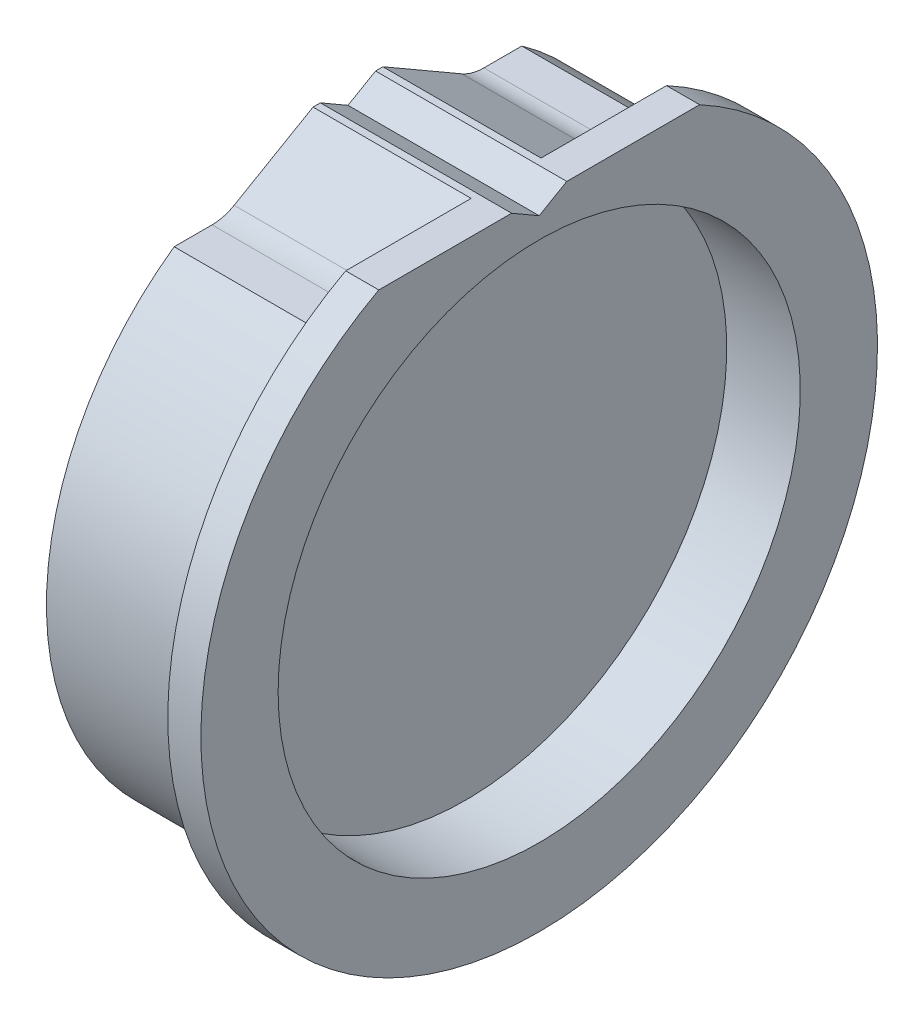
ISO-10303-21;
HEADER;
FILE_DESCRIPTION(('STEP AP214'),'2;1');
FILE_NAME('part.step','',(''),(''),'','','');
FILE_SCHEMA(('AUTOMOTIVE_DESIGN { 1 0 10303 214 1 1 1 1 }'));
ENDSEC;
DATA;
#1=APPLICATION_CONTEXT('core data for automotive mechanical design processes');
#2=APPLICATION_PROTOCOL_DEFINITION('international standard','automotive_design',2000,#1);
#3=PRODUCT_CONTEXT('',#1,'mechanical');
#4=PRODUCT('Part','Part','',(#3));
#5=PRODUCT_RELATED_PRODUCT_CATEGORY('part','',(#4));
#6=PRODUCT_DEFINITION_FORMATION('','',#4);
#7=PRODUCT_DEFINITION_CONTEXT('part definition',#1,'design');
#8=PRODUCT_DEFINITION('design','',#6,#7);
#9=PRODUCT_DEFINITION_SHAPE('','',#8);
#10=(LENGTH_UNIT() NAMED_UNIT(*) SI_UNIT(.MILLI.,.METRE.));
#11=(NAMED_UNIT(*) PLANE_ANGLE_UNIT() SI_UNIT($,.RADIAN.));
#12=(NAMED_UNIT(*) SI_UNIT($,.STERADIAN.) SOLID_ANGLE_UNIT());
#13=UNCERTAINTY_MEASURE_WITH_UNIT(LENGTH_MEASURE(1.E-05),#10,'distance_accuracy_value','');
#14=(GEOMETRIC_REPRESENTATION_CONTEXT(3) GLOBAL_UNCERTAINTY_ASSIGNED_CONTEXT((#13)) GLOBAL_UNIT_ASSIGNED_CONTEXT((#10,
#11,#12)) REPRESENTATION_CONTEXT('',''));
#15=CARTESIAN_POINT('',(0.,0.,0.));
#16=DIRECTION('',(0.,0.,1.));
#17=DIRECTION('',(1.,0.,0.));
#18=AXIS2_PLACEMENT_3D('',#15,#16,#17);
#19=CARTESIAN_POINT('',(5.5,46.,0.));
#20=DIRECTION('',(1.,0.,0.));
#21=DIRECTION('',(0.,0.,-1.));
#22=AXIS2_PLACEMENT_3D('',#19,#20,#21);
#23=PLANE('',#22);
#24=DIRECTION('',(0.,0.,1.));
#25=VECTOR('',#24,1.);
#26=CARTESIAN_POINT('',(5.5,33.5,-31.5238005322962));
#27=LINE('',#26,#25);
#28=CARTESIAN_POINT('',(5.5,33.5,-23.6378933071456));
#29=VERTEX_POINT('',#28);
#30=CARTESIAN_POINT('',(5.5,33.5,-18.4820508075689));
#31=VERTEX_POINT('',#30);
#32=EDGE_CURVE('E185',#29,#31,#27,.T.);
#33=ORIENTED_EDGE('',*,*,#32,.T.);
#34=CARTESIAN_POINT('',(5.5,39.5,-18.4820508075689));
#35=DIRECTION('',(1.,0.,0.));
#36=DIRECTION('',(0.,0.,-1.));
#37=AXIS2_PLACEMENT_3D('',#34,#35,#36);
#38=CIRCLE('',#37,6.);
#39=CARTESIAN_POINT('',(5.5,34.3038475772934,-15.4820508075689));
#40=VERTEX_POINT('',#39);
#41=EDGE_CURVE('E459',#31,#40,#38,.F.);
#42=ORIENTED_EDGE('',*,*,#41,.T.);
#43=DIRECTION('',(0.,0.5,0.866025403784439));
#44=VECTOR('',#43,1.);
#45=CARTESIAN_POINT('',(5.5,40.5,-4.75));
#46=LINE('',#45,#44);
#47=CARTESIAN_POINT('',(5.5,40.5,-4.75));
#48=VERTEX_POINT('',#47);
#49=EDGE_CURVE('E187',#40,#48,#46,.T.);
#50=ORIENTED_EDGE('',*,*,#49,.T.);
#51=DIRECTION('',(0.,0.,-1.));
#52=VECTOR('',#51,1.);
#53=CARTESIAN_POINT('',(5.5,40.5,0.));
#54=LINE('',#53,#52);
#55=CARTESIAN_POINT('',(5.5,40.5,-21.8116941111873));
#56=VERTEX_POINT('',#55);
#57=EDGE_CURVE('E236',#48,#56,#54,.T.);
#58=ORIENTED_EDGE('',*,*,#57,.T.);
#59=CARTESIAN_POINT('',(5.5,0.,0.));
#60=DIRECTION('',(-1.,0.,0.));
#61=DIRECTION('',(0.,0.,1.));
#62=AXIS2_PLACEMENT_3D('',#59,#60,#61);
#63=CIRCLE('',#62,46.);
#64=CARTESIAN_POINT('',(5.5,3.,-45.902069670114));
#65=VERTEX_POINT('',#64);
#66=EDGE_CURVE('E281',#56,#65,#63,.T.);
#67=ORIENTED_EDGE('',*,*,#66,.T.);
#68=DIRECTION('',(0.,0.,-1.));
#69=VECTOR('',#68,1.);
#70=CARTESIAN_POINT('',(5.5,3.,6.9462219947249));
#71=LINE('',#70,#69);
#72=CARTESIAN_POINT('',(5.5,3.,-42.));
#73=VERTEX_POINT('',#72);
#74=EDGE_CURVE('E180',#73,#65,#71,.T.);
#75=ORIENTED_EDGE('',*,*,#74,.F.);
#76=DIRECTION('',(0.,-1.,0.));
#77=VECTOR('',#76,1.);
#78=CARTESIAN_POINT('',(5.5,3.,-42.));
#79=LINE('',#78,#77);
#80=CARTESIAN_POINT('',(5.5,-3.,-42.));
#81=VERTEX_POINT('',#80);
#82=EDGE_CURVE('E172',#73,#81,#79,.T.);
#83=ORIENTED_EDGE('',*,*,#82,.T.);
#84=DIRECTION('',(0.,0.,-1.));
#85=VECTOR('',#84,1.);
#86=CARTESIAN_POINT('',(5.5,-3.,6.9462219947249));
#87=LINE('',#86,#85);
#88=CARTESIAN_POINT('',(5.5,-3.,-45.902069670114));
#89=VERTEX_POINT('',#88);
#90=EDGE_CURVE('E158',#81,#89,#87,.T.);
#91=ORIENTED_EDGE('',*,*,#90,.T.);
#92=CARTESIAN_POINT('',(5.5,40.5,21.8116941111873));
#93=VERTEX_POINT('',#92);
#94=EDGE_CURVE('E280',#89,#93,#63,.T.);
#95=ORIENTED_EDGE('',*,*,#94,.T.);
#96=CARTESIAN_POINT('',(5.5,40.5,4.75));
#97=VERTEX_POINT('',#96);
#98=EDGE_CURVE('E240',#93,#97,#54,.T.);
#99=ORIENTED_EDGE('',*,*,#98,.T.);
#100=DIRECTION('',(0.,-0.5,0.866025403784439));
#101=VECTOR('',#100,1.);
#102=CARTESIAN_POINT('',(5.5,40.5,4.75));
#103=LINE('',#102,#101);
#104=CARTESIAN_POINT('',(5.5,34.3038475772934,15.4820508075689));
#105=VERTEX_POINT('',#104);
#106=EDGE_CURVE('E205',#97,#105,#103,.T.);
#107=ORIENTED_EDGE('',*,*,#106,.T.);
#108=CARTESIAN_POINT('',(5.5,39.5,18.4820508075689));
#109=DIRECTION('',(1.,0.,0.));
#110=DIRECTION('',(0.,0.,-1.));
#111=AXIS2_PLACEMENT_3D('',#108,#109,#110);
#112=CIRCLE('',#111,6.);
#113=CARTESIAN_POINT('',(5.5,33.5,18.4820508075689));
#114=VERTEX_POINT('',#113);
#115=EDGE_CURVE('E457',#105,#114,#112,.F.);
#116=ORIENTED_EDGE('',*,*,#115,.T.);
#117=DIRECTION('',(0.,0.,1.));
#118=VECTOR('',#117,1.);
#119=CARTESIAN_POINT('',(5.5,33.5,31.5238005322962));
#120=LINE('',#119,#118);
#121=CARTESIAN_POINT('',(5.5,33.5,23.6378933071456));
#122=VERTEX_POINT('',#121);
#123=EDGE_CURVE('E202',#114,#122,#120,.T.);
#124=ORIENTED_EDGE('',*,*,#123,.T.);
#125=CARTESIAN_POINT('',(5.5,0.,0.));
#126=DIRECTION('',(-1.,0.,0.));
#127=DIRECTION('',(0.,0.,1.));
#128=AXIS2_PLACEMENT_3D('',#125,#126,#127);
#129=CIRCLE('',#128,41.);
#130=EDGE_CURVE('E284',#29,#122,#129,.T.);
#131=ORIENTED_EDGE('',*,*,#130,.F.);
#132=EDGE_LOOP('',(#33,#42,#50,#58,#67,#75,#83,#91,#95,#99,#107,#116,#124,#131));
#133=FACE_BOUND('',#132,.T.);
#134=ADVANCED_FACE('F16',(#133),#23,.F.);
#135=CARTESIAN_POINT('',(0.,0.,0.));
#136=DIRECTION('',(-1.,0.,0.));
#137=DIRECTION('',(0.,0.,1.));
#138=AXIS2_PLACEMENT_3D('',#135,#136,#137);
#139=CYLINDRICAL_SURFACE('',#138,46.);
#140=DIRECTION('',(-1.,0.,0.));
#141=VECTOR('',#140,1.);
#142=CARTESIAN_POINT('',(0.,3.,-45.902069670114));
#143=LINE('',#142,#141);
#144=CARTESIAN_POINT('',(6.,3.,-45.902069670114));
#145=VERTEX_POINT('',#144);
#146=EDGE_CURVE('E452',#65,#145,#143,.F.);
#147=ORIENTED_EDGE('',*,*,#146,.F.);
#148=ORIENTED_EDGE('',*,*,#66,.F.);
#149=DIRECTION('',(-1.,0.,0.));
#150=VECTOR('',#149,1.);
#151=CARTESIAN_POINT('',(19.4,40.5,-21.8116941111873));
#152=LINE('',#151,#150);
#153=CARTESIAN_POINT('',(10.,40.5,-21.8116941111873));
#154=VERTEX_POINT('',#153);
#155=EDGE_CURVE('E232',#154,#56,#152,.T.);
#156=ORIENTED_EDGE('',*,*,#155,.F.);
#157=CARTESIAN_POINT('',(10.,0.,0.));
#158=DIRECTION('',(-1.,0.,0.));
#159=DIRECTION('',(0.,0.,1.));
#160=AXIS2_PLACEMENT_3D('',#157,#158,#159);
#161=CIRCLE('',#160,46.);
#162=CARTESIAN_POINT('',(10.,40.5,21.8116941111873));
#163=VERTEX_POINT('',#162);
#164=EDGE_CURVE('E277',#154,#163,#161,.T.);
#165=ORIENTED_EDGE('',*,*,#164,.T.);
#166=DIRECTION('',(-1.,0.,0.));
#167=VECTOR('',#166,1.);
#168=CARTESIAN_POINT('',(19.4,40.5,21.8116941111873));
#169=LINE('',#168,#167);
#170=EDGE_CURVE('E233',#163,#93,#169,.T.);
#171=ORIENTED_EDGE('',*,*,#170,.T.);
#172=ORIENTED_EDGE('',*,*,#94,.F.);
#173=DIRECTION('',(-1.,0.,0.));
#174=VECTOR('',#173,1.);
#175=CARTESIAN_POINT('',(0.,-3.,-45.902069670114));
#176=LINE('',#175,#174);
#177=CARTESIAN_POINT('',(6.,-3.,-45.902069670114));
#178=VERTEX_POINT('',#177);
#179=EDGE_CURVE('E306',#178,#89,#176,.T.);
#180=ORIENTED_EDGE('',*,*,#179,.F.);
#181=CARTESIAN_POINT('',(5.5,2.95803989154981,-45.9047927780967));
#182=CARTESIAN_POINT('',(5.58304782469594,2.97208582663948,-45.9038859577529));
#183=CARTESIAN_POINT('',(5.6666882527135,2.98261794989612,-45.9032024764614));
#184=CARTESIAN_POINT('',(5.83455677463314,2.99661640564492,-45.9022916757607));
#185=CARTESIAN_POINT('',(5.91878483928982,3.00008308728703,-45.9020643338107));
#186=CARTESIAN_POINT('',(6.08717422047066,2.99991395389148,-45.9020751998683));
#187=CARTESIAN_POINT('',(6.17133553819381,2.99628363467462,-45.9023130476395));
#188=CARTESIAN_POINT('',(6.33902988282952,2.98197088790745,-45.9032449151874));
#189=CARTESIAN_POINT('',(6.42256291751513,2.97128854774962,-45.9039389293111));
#190=CARTESIAN_POINT('',(6.67141565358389,2.92873069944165,-45.9066816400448));
#191=CARTESIAN_POINT('',(6.83506174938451,2.88634422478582,-45.9093910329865));
#192=CARTESIAN_POINT('',(7.15279004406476,2.77479039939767,-45.9162674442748));
#193=CARTESIAN_POINT('',(7.30687391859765,2.70562775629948,-45.9204342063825));
#194=CARTESIAN_POINT('',(7.60141183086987,2.54240749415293,-45.9297597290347));
#195=CARTESIAN_POINT('',(7.7418535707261,2.44832769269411,-45.9349193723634));
#196=CARTESIAN_POINT('',(8.00498375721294,2.23795121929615,-45.9456487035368));
#197=CARTESIAN_POINT('',(8.12766933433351,2.12165096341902,-45.9512184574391));
#198=CARTESIAN_POINT('',(8.35200331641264,1.86990675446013,-45.9621509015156));
#199=CARTESIAN_POINT('',(8.45361558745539,1.73443057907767,-45.9675132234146));
#200=CARTESIAN_POINT('',(8.63264798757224,1.44832339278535,-45.977416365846));
#201=CARTESIAN_POINT('',(8.71006968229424,1.29769336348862,-45.9819572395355));
#202=CARTESIAN_POINT('',(8.83849919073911,0.985590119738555,-45.98970479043));
#203=CARTESIAN_POINT('',(8.8895158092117,0.824120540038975,-45.9929119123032));
#204=CARTESIAN_POINT('',(8.96370863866,0.494880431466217,-45.9976323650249));
#205=CARTESIAN_POINT('',(8.98688466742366,0.32710986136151,-45.9991456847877));
#206=CARTESIAN_POINT('',(9.00470975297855,-0.00962536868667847,-46.0003065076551));
#207=CARTESIAN_POINT('',(8.9994129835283,-0.178587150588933,-45.9999575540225));
#208=CARTESIAN_POINT('',(8.96057088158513,-0.513216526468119,-45.997441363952));
#209=CARTESIAN_POINT('',(8.92702574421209,-0.678884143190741,-45.9952741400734));
#210=CARTESIAN_POINT('',(8.83267336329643,-1.00214714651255,-45.9893666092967));
#211=CARTESIAN_POINT('',(8.77187922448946,-1.15974637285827,-45.9856270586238));
#212=CARTESIAN_POINT('',(8.6247653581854,-1.46250976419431,-45.9769945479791));
#213=CARTESIAN_POINT('',(8.53844523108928,-1.60767373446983,-45.972101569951));
#214=CARTESIAN_POINT('',(8.34255690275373,-1.88171278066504,-45.9617016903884));
#215=CARTESIAN_POINT('',(8.23294936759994,-2.01055970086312,-45.9561937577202));
#216=CARTESIAN_POINT('',(7.9936770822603,-2.2480350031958,-45.9451901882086));
#217=CARTESIAN_POINT('',(7.86401317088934,-2.35666423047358,-45.9396945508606));
#218=CARTESIAN_POINT('',(7.58813190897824,-2.55074795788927,-45.9293280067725));
#219=CARTESIAN_POINT('',(7.44189655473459,-2.63617690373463,-45.9244577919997));
#220=CARTESIAN_POINT('',(7.13706868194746,-2.78128913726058,-45.9158985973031));
#221=CARTESIAN_POINT('',(6.97847238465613,-2.84096451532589,-45.9122099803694));
#222=CARTESIAN_POINT('',(6.65359800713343,-2.9327990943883,-45.9064354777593));
#223=CARTESIAN_POINT('',(6.48732410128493,-2.96497306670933,-45.9043487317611));
#224=CARTESIAN_POINT('',(6.15185853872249,-3.00088360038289,-45.902015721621));
#225=CARTESIAN_POINT('',(5.98267175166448,-3.00466373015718,-45.901766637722));
#226=CARTESIAN_POINT('',(5.76183290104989,-2.99100112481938,-45.9026567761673));
#227=CARTESIAN_POINT('',(5.7091796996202,-2.98633962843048,-45.9029607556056));
#228=CARTESIAN_POINT('',(5.60428115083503,-2.97425296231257,-45.9037456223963));
#229=CARTESIAN_POINT('',(5.55203527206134,-2.96683238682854,-45.9042262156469));
#230=CARTESIAN_POINT('',(5.5,-2.95803989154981,-45.9047927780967));
#231=B_SPLINE_CURVE_WITH_KNOTS('',3,(#181,#182,#183,#184,#185,#186,#187,#188,#189,#190,#191,
#192,#193,#194,#195,#196,#197,#198,#199,#200,#201,#202,#203,#204,#205,#206,#207,#208,#209,#210,
#211,#212,#213,#214,#215,#216,#217,#218,#219,#220,#221,#222,#223,#224,#225,#226,#227,#228,#229,
#230),.UNSPECIFIED.,.F.,.F.,(4,2,2,2,2,2,2,2,2,2,2,2,2,2,2,2,2,2,2,2,2,2,2,2,4),(0.,
0.25261434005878,0.50521619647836,0.757622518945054,1.01002571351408,1.51461656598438,
2.01911874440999,2.52407157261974,3.02910591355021,3.53499919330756,4.04085972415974,
4.54655146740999,5.05224652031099,5.55697975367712,6.06170950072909,6.5661967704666,
7.07069193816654,7.57604610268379,8.08137913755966,8.58726654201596,9.09330920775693,
9.59907990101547,10.1040743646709,10.262602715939,10.4208682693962),.UNSPECIFIED.);
#232=EDGE_CURVE('E154',#145,#178,#231,.T.);
#233=ORIENTED_EDGE('',*,*,#232,.F.);
#234=EDGE_LOOP('',(#147,#148,#156,#165,#171,#172,#180,#233));
#235=FACE_BOUND('',#234,.T.);
#236=ADVANCED_FACE('F308',(#235),#139,.T.);
#237=CARTESIAN_POINT('',(19.4,40.5,21.8116941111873));
#238=DIRECTION('',(0.,-1.,0.));
#239=DIRECTION('',(0.,0.,-1.));
#240=AXIS2_PLACEMENT_3D('',#237,#238,#239);
#241=PLANE('',#240);
#242=DIRECTION('',(-1.,0.,0.));
#243=VECTOR('',#242,1.);
#244=CARTESIAN_POINT('',(33.1737492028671,40.5,4.75));
#245=LINE('',#244,#243);
#246=CARTESIAN_POINT('',(-16.,40.5,4.75));
#247=VERTEX_POINT('',#246);
#248=EDGE_CURVE('E200',#97,#247,#245,.T.);
#249=ORIENTED_EDGE('',*,*,#248,.F.);
#250=ORIENTED_EDGE('',*,*,#98,.F.);
#251=ORIENTED_EDGE('',*,*,#170,.F.);
#252=DIRECTION('',(0.,0.,1.));
#253=VECTOR('',#252,1.);
#254=CARTESIAN_POINT('',(10.,40.5,0.));
#255=LINE('',#254,#253);
#256=CARTESIAN_POINT('',(10.,40.5,3.75));
#257=VERTEX_POINT('',#256);
#258=EDGE_CURVE('E296',#257,#163,#255,.T.);
#259=ORIENTED_EDGE('',*,*,#258,.F.);
#260=DIRECTION('',(-1.,0.,0.));
#261=VECTOR('',#260,1.);
#262=CARTESIAN_POINT('',(10.001,40.5,3.75));
#263=LINE('',#262,#261);
#264=CARTESIAN_POINT('',(-16.,40.5,3.75));
#265=VERTEX_POINT('',#264);
#266=EDGE_CURVE('E221',#257,#265,#263,.T.);
#267=ORIENTED_EDGE('',*,*,#266,.T.);
#268=DIRECTION('',(0.,0.,1.));
#269=VECTOR('',#268,1.);
#270=CARTESIAN_POINT('',(-16.,40.5,21.8116941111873));
#271=LINE('',#270,#269);
#272=EDGE_CURVE('E224',#265,#247,#271,.T.);
#273=ORIENTED_EDGE('',*,*,#272,.T.);
#274=EDGE_LOOP('',(#249,#250,#251,#259,#267,#273));
#275=FACE_BOUND('',#274,.T.);
#276=ADVANCED_FACE('F355',(#275),#241,.F.);
#277=CARTESIAN_POINT('',(-10.,0.,0.));
#278=DIRECTION('',(1.,0.,0.));
#279=DIRECTION('',(0.,0.,-1.));
#280=AXIS2_PLACEMENT_3D('',#277,#278,#279);
#281=PLANE('',#280);
#282=CARTESIAN_POINT('',(-10.,0.,0.));
#283=DIRECTION('',(-1.,0.,0.));
#284=DIRECTION('',(0.,0.,1.));
#285=AXIS2_PLACEMENT_3D('',#282,#283,#284);
#286=CIRCLE('',#285,20.);
#287=CARTESIAN_POINT('',(-10.,0.,20.));
#288=VERTEX_POINT('',#287);
#289=EDGE_CURVE('E293',#288,#288,#286,.T.);
#290=ORIENTED_EDGE('',*,*,#289,.T.);
#291=EDGE_LOOP('',(#290));
#292=FACE_BOUND('',#291,.T.);
#293=ADVANCED_FACE('F18',(#292),#281,.F.);
#294=CARTESIAN_POINT('',(0.,0.,0.));
#295=DIRECTION('',(-1.,0.,0.));
#296=DIRECTION('',(0.,0.,1.));
#297=AXIS2_PLACEMENT_3D('',#294,#295,#296);
#298=CYLINDRICAL_SURFACE('',#297,20.);
#299=ORIENTED_EDGE('',*,*,#289,.F.);
#300=EDGE_LOOP('',(#299));
#301=FACE_BOUND('',#300,.T.);
#302=CARTESIAN_POINT('',(-16.,0.,0.));
#303=DIRECTION('',(-1.,0.,0.));
#304=DIRECTION('',(0.,0.,1.));
#305=AXIS2_PLACEMENT_3D('',#302,#303,#304);
#306=CIRCLE('',#305,20.);
#307=CARTESIAN_POINT('',(-16.,0.,20.));
#308=VERTEX_POINT('',#307);
#309=EDGE_CURVE('E290',#308,#308,#306,.T.);
#310=ORIENTED_EDGE('',*,*,#309,.T.);
#311=EDGE_LOOP('',(#310));
#312=FACE_BOUND('',#311,.T.);
#313=ADVANCED_FACE('F423',(#301,#312),#298,.F.);
#314=CARTESIAN_POINT('',(-16.,20.,0.));
#315=DIRECTION('',(1.,0.,0.));
#316=DIRECTION('',(0.,0.,-1.));
#317=AXIS2_PLACEMENT_3D('',#314,#315,#316);
#318=PLANE('',#317);
#319=CARTESIAN_POINT('',(-16.,31.5,0.));
#320=DIRECTION('',(-1.,0.,0.));
#321=DIRECTION('',(0.,0.,1.));
#322=AXIS2_PLACEMENT_3D('',#319,#320,#321);
#323=CIRCLE('',#322,3.);
#324=CARTESIAN_POINT('',(-16.,31.5,3.));
#325=VERTEX_POINT('',#324);
#326=EDGE_CURVE('E241',#325,#325,#323,.T.);
#327=ORIENTED_EDGE('',*,*,#326,.F.);
#328=EDGE_LOOP('',(#327));
#329=FACE_BOUND('',#328,.T.);
#330=CARTESIAN_POINT('',(-16.,-22.2738636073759,-22.2738636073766));
#331=DIRECTION('',(-1.,0.,0.));
#332=DIRECTION('',(0.,0.,1.));
#333=AXIS2_PLACEMENT_3D('',#330,#331,#332);
#334=CIRCLE('',#333,2.5);
#335=CARTESIAN_POINT('',(-16.,-22.2738636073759,-19.7738636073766));
#336=VERTEX_POINT('',#335);
#337=EDGE_CURVE('E250',#336,#336,#334,.T.);
#338=ORIENTED_EDGE('',*,*,#337,.F.);
#339=EDGE_LOOP('',(#338));
#340=FACE_BOUND('',#339,.T.);
#341=CARTESIAN_POINT('',(-16.,-22.2738636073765,22.273863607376));
#342=DIRECTION('',(-1.,0.,0.));
#343=DIRECTION('',(0.,0.,1.));
#344=AXIS2_PLACEMENT_3D('',#341,#342,#343);
#345=CIRCLE('',#344,2.5);
#346=CARTESIAN_POINT('',(-16.,-22.2738636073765,24.773863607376));
#347=VERTEX_POINT('',#346);
#348=EDGE_CURVE('E256',#347,#347,#345,.T.);
#349=ORIENTED_EDGE('',*,*,#348,.F.);
#350=EDGE_LOOP('',(#349));
#351=FACE_BOUND('',#350,.T.);
#352=CARTESIAN_POINT('',(-16.,22.2738636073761,22.2738636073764));
#353=DIRECTION('',(-1.,0.,0.));
#354=DIRECTION('',(0.,0.,1.));
#355=AXIS2_PLACEMENT_3D('',#352,#353,#354);
#356=CIRCLE('',#355,2.5);
#357=CARTESIAN_POINT('',(-16.,22.2738636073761,24.7738636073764));
#358=VERTEX_POINT('',#357);
#359=EDGE_CURVE('E262',#358,#358,#356,.T.);
#360=ORIENTED_EDGE('',*,*,#359,.F.);
#361=EDGE_LOOP('',(#360));
#362=FACE_BOUND('',#361,.T.);
#363=CARTESIAN_POINT('',(-16.,22.2738636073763,-22.2738636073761));
#364=DIRECTION('',(-1.,0.,0.));
#365=DIRECTION('',(0.,0.,1.));
#366=AXIS2_PLACEMENT_3D('',#363,#364,#365);
#367=CIRCLE('',#366,2.5);
#368=CARTESIAN_POINT('',(-16.,22.2738636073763,-19.7738636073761));
#369=VERTEX_POINT('',#368);
#370=EDGE_CURVE('E268',#369,#369,#367,.T.);
#371=ORIENTED_EDGE('',*,*,#370,.F.);
#372=EDGE_LOOP('',(#371));
#373=FACE_BOUND('',#372,.T.);
#374=ORIENTED_EDGE('',*,*,#309,.F.);
#375=EDGE_LOOP('',(#374));
#376=FACE_BOUND('',#375,.T.);
#377=DIRECTION('',(0.,0.5,0.866025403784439));
#378=VECTOR('',#377,1.);
#379=CARTESIAN_POINT('',(-16.,40.5,-4.75));
#380=LINE('',#379,#378);
#381=CARTESIAN_POINT('',(-16.,34.3038475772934,-15.4820508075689));
#382=VERTEX_POINT('',#381);
#383=CARTESIAN_POINT('',(-16.,40.5,-4.75));
#384=VERTEX_POINT('',#383);
#385=EDGE_CURVE('E175',#382,#384,#380,.T.);
#386=ORIENTED_EDGE('',*,*,#385,.F.);
#387=CARTESIAN_POINT('',(-16.,39.5,-18.4820508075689));
#388=DIRECTION('',(1.,0.,0.));
#389=DIRECTION('',(0.,0.,-1.));
#390=AXIS2_PLACEMENT_3D('',#387,#388,#389);
#391=CIRCLE('',#390,6.);
#392=CARTESIAN_POINT('',(-16.,33.5,-18.4820508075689));
#393=VERTEX_POINT('',#392);
#394=EDGE_CURVE('E24',#382,#393,#391,.T.);
#395=ORIENTED_EDGE('',*,*,#394,.T.);
#396=DIRECTION('',(0.,0.,1.));
#397=VECTOR('',#396,1.);
#398=CARTESIAN_POINT('',(-16.,33.5,-31.5238005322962));
#399=LINE('',#398,#397);
#400=CARTESIAN_POINT('',(-16.,33.5,-23.6378933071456));
#401=VERTEX_POINT('',#400);
#402=EDGE_CURVE('E171',#401,#393,#399,.T.);
#403=ORIENTED_EDGE('',*,*,#402,.F.);
#404=CARTESIAN_POINT('',(-16.,0.,0.));
#405=DIRECTION('',(-1.,0.,0.));
#406=DIRECTION('',(0.,0.,1.));
#407=AXIS2_PLACEMENT_3D('',#404,#405,#406);
#408=CIRCLE('',#407,41.);
#409=CARTESIAN_POINT('',(-16.,33.5,23.6378933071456));
#410=VERTEX_POINT('',#409);
#411=EDGE_CURVE('E287',#401,#410,#408,.T.);
#412=ORIENTED_EDGE('',*,*,#411,.T.);
#413=DIRECTION('',(0.,0.,1.));
#414=VECTOR('',#413,1.);
#415=CARTESIAN_POINT('',(-16.,33.5,31.5238005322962));
#416=LINE('',#415,#414);
#417=CARTESIAN_POINT('',(-16.,33.5,18.4820508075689));
#418=VERTEX_POINT('',#417);
#419=EDGE_CURVE('E198',#418,#410,#416,.T.);
#420=ORIENTED_EDGE('',*,*,#419,.F.);
#421=CARTESIAN_POINT('',(-16.,39.5,18.4820508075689));
#422=DIRECTION('',(1.,0.,0.));
#423=DIRECTION('',(0.,0.,-1.));
#424=AXIS2_PLACEMENT_3D('',#421,#422,#423);
#425=CIRCLE('',#424,6.);
#426=CARTESIAN_POINT('',(-16.,34.3038475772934,15.4820508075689));
#427=VERTEX_POINT('',#426);
#428=EDGE_CURVE('E11',#418,#427,#425,.T.);
#429=ORIENTED_EDGE('',*,*,#428,.T.);
#430=DIRECTION('',(0.,-0.5,0.866025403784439));
#431=VECTOR('',#430,1.);
#432=CARTESIAN_POINT('',(-16.,40.5,4.75));
#433=LINE('',#432,#431);
#434=EDGE_CURVE('E197',#247,#427,#433,.T.);
#435=ORIENTED_EDGE('',*,*,#434,.F.);
#436=ORIENTED_EDGE('',*,*,#272,.F.);
#437=DIRECTION('',(0.,0.5,0.866025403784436));
#438=VECTOR('',#437,1.);
#439=CARTESIAN_POINT('',(-16.,38.3349364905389,0.));
#440=LINE('',#439,#438);
#441=CARTESIAN_POINT('',(-16.,38.3349364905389,0.));
#442=VERTEX_POINT('',#441);
#443=EDGE_CURVE('E216',#442,#265,#440,.T.);
#444=ORIENTED_EDGE('',*,*,#443,.F.);
#445=DIRECTION('',(0.,-0.5,0.866025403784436));
#446=VECTOR('',#445,1.);
#447=CARTESIAN_POINT('',(-16.,40.5,-3.75));
#448=LINE('',#447,#446);
#449=CARTESIAN_POINT('',(-16.,40.5,-3.75));
#450=VERTEX_POINT('',#449);
#451=EDGE_CURVE('E218',#450,#442,#448,.T.);
#452=ORIENTED_EDGE('',*,*,#451,.F.);
#453=EDGE_CURVE('E230',#384,#450,#271,.T.);
#454=ORIENTED_EDGE('',*,*,#453,.F.);
#455=EDGE_LOOP('',(#386,#395,#403,#412,#420,#429,#435,#436,#444,#452,#454));
#456=FACE_BOUND('',#455,.T.);
#457=ADVANCED_FACE('F410',(#329,#340,#351,#362,#373,#376,#456),#318,.F.);
#458=CARTESIAN_POINT('',(0.,0.,0.));
#459=DIRECTION('',(-1.,0.,0.));
#460=DIRECTION('',(0.,0.,1.));
#461=AXIS2_PLACEMENT_3D('',#458,#459,#460);
#462=CYLINDRICAL_SURFACE('',#461,41.);
#463=ORIENTED_EDGE('',*,*,#411,.F.);
#464=DIRECTION('',(-1.,0.,0.));
#465=VECTOR('',#464,1.);
#466=CARTESIAN_POINT('',(0.,33.5,-23.6378933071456));
#467=LINE('',#466,#465);
#468=EDGE_CURVE('E194',#401,#29,#467,.F.);
#469=ORIENTED_EDGE('',*,*,#468,.T.);
#470=ORIENTED_EDGE('',*,*,#130,.T.);
#471=DIRECTION('',(-1.,0.,0.));
#472=VECTOR('',#471,1.);
#473=CARTESIAN_POINT('',(0.,33.5,23.6378933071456));
#474=LINE('',#473,#472);
#475=EDGE_CURVE('E204',#122,#410,#474,.T.);
#476=ORIENTED_EDGE('',*,*,#475,.T.);
#477=EDGE_LOOP('',(#463,#469,#470,#476));
#478=FACE_BOUND('',#477,.T.);
#479=ADVANCED_FACE('F404',(#478),#462,.T.);
#480=CARTESIAN_POINT('',(10.,46.,0.));
#481=DIRECTION('',(-1.,0.,0.));
#482=DIRECTION('',(0.,0.,1.));
#483=AXIS2_PLACEMENT_3D('',#480,#481,#482);
#484=PLANE('',#483);
#485=DIRECTION('',(0.,0.5,-0.866025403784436));
#486=VECTOR('',#485,1.);
#487=CARTESIAN_POINT('',(10.,40.5,-3.75));
#488=LINE('',#487,#486);
#489=CARTESIAN_POINT('',(10.,38.3349364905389,0.));
#490=VERTEX_POINT('',#489);
#491=CARTESIAN_POINT('',(10.,40.5,-3.75));
#492=VERTEX_POINT('',#491);
#493=EDGE_CURVE('E211',#490,#492,#488,.T.);
#494=ORIENTED_EDGE('',*,*,#493,.F.);
#495=DIRECTION('',(0.,-0.5,-0.866025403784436));
#496=VECTOR('',#495,1.);
#497=CARTESIAN_POINT('',(10.,38.3349364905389,0.));
#498=LINE('',#497,#496);
#499=EDGE_CURVE('E213',#257,#490,#498,.T.);
#500=ORIENTED_EDGE('',*,*,#499,.F.);
#501=ORIENTED_EDGE('',*,*,#258,.T.);
#502=ORIENTED_EDGE('',*,*,#164,.F.);
#503=EDGE_CURVE('E297',#154,#492,#255,.T.);
#504=ORIENTED_EDGE('',*,*,#503,.T.);
#505=EDGE_LOOP('',(#494,#500,#501,#502,#504));
#506=FACE_BOUND('',#505,.T.);
#507=CARTESIAN_POINT('',(10.,0.,0.));
#508=DIRECTION('',(-1.,0.,0.));
#509=DIRECTION('',(0.,0.,1.));
#510=AXIS2_PLACEMENT_3D('',#507,#508,#509);
#511=CIRCLE('',#510,35.5);
#512=CARTESIAN_POINT('',(10.,0.,35.5));
#513=VERTEX_POINT('',#512);
#514=EDGE_CURVE('E274',#513,#513,#511,.T.);
#515=ORIENTED_EDGE('',*,*,#514,.T.);
#516=EDGE_LOOP('',(#515));
#517=FACE_BOUND('',#516,.T.);
#518=ADVANCED_FACE('F401',(#506,#517),#484,.F.);
#519=CARTESIAN_POINT('',(0.,0.,0.));
#520=DIRECTION('',(-1.,0.,0.));
#521=DIRECTION('',(0.,0.,1.));
#522=AXIS2_PLACEMENT_3D('',#519,#520,#521);
#523=CYLINDRICAL_SURFACE('',#522,35.5);
#524=ORIENTED_EDGE('',*,*,#514,.F.);
#525=EDGE_LOOP('',(#524));
#526=FACE_BOUND('',#525,.T.);
#527=CARTESIAN_POINT('',(0.,0.,0.));
#528=DIRECTION('',(-1.,0.,0.));
#529=DIRECTION('',(0.,0.,1.));
#530=AXIS2_PLACEMENT_3D('',#527,#528,#529);
#531=CIRCLE('',#530,35.5);
#532=CARTESIAN_POINT('',(0.,0.,35.5));
#533=VERTEX_POINT('',#532);
#534=EDGE_CURVE('E271',#533,#533,#531,.T.);
#535=ORIENTED_EDGE('',*,*,#534,.T.);
#536=EDGE_LOOP('',(#535));
#537=FACE_BOUND('',#536,.T.);
#538=ADVANCED_FACE('F398',(#526,#537),#523,.F.);
#539=CARTESIAN_POINT('',(0.,35.5,0.));
#540=DIRECTION('',(-1.,0.,0.));
#541=DIRECTION('',(0.,0.,1.));
#542=AXIS2_PLACEMENT_3D('',#539,#540,#541);
#543=PLANE('',#542);
#544=ORIENTED_EDGE('',*,*,#534,.F.);
#545=EDGE_LOOP('',(#544));
#546=FACE_BOUND('',#545,.T.);
#547=ADVANCED_FACE('F394',(#546),#543,.F.);
#548=CARTESIAN_POINT('',(-16.,22.2738636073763,-22.2738636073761));
#549=DIRECTION('',(-1.,0.,0.));
#550=DIRECTION('',(0.,0.,1.));
#551=AXIS2_PLACEMENT_3D('',#548,#549,#550);
#552=CYLINDRICAL_SURFACE('',#551,2.5);
#553=CARTESIAN_POINT('',(-2.,22.2738636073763,-22.2738636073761));
#554=DIRECTION('',(-1.,0.,0.));
#555=DIRECTION('',(0.,0.,1.));
#556=AXIS2_PLACEMENT_3D('',#553,#554,#555);
#557=CIRCLE('',#556,2.5);
#558=CARTESIAN_POINT('',(-2.,22.2738636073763,-19.7738636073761));
#559=VERTEX_POINT('',#558);
#560=EDGE_CURVE('E265',#559,#559,#557,.T.);
#561=ORIENTED_EDGE('',*,*,#560,.F.);
#562=EDGE_LOOP('',(#561));
#563=FACE_BOUND('',#562,.T.);
#564=ORIENTED_EDGE('',*,*,#370,.T.);
#565=EDGE_LOOP('',(#564));
#566=FACE_BOUND('',#565,.T.);
#567=ADVANCED_FACE('F390',(#563,#566),#552,.F.);
#568=CARTESIAN_POINT('',(-2.,22.2738636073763,-22.2738636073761));
#569=DIRECTION('',(-1.,0.,0.));
#570=DIRECTION('',(0.,0.,1.));
#571=AXIS2_PLACEMENT_3D('',#568,#569,#570);
#572=CONICAL_SURFACE('',#571,2.5,1.02974425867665);
#573=CARTESIAN_POINT('',(-0.497848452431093,22.2738636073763,-22.2738636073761));
#574=VERTEX_POINT('',#573);
#575=VERTEX_LOOP('',#574);
#576=FACE_BOUND('',#575,.T.);
#577=ORIENTED_EDGE('',*,*,#560,.T.);
#578=EDGE_LOOP('',(#577));
#579=FACE_BOUND('',#578,.T.);
#580=ADVANCED_FACE('F386',(#576,#579),#572,.F.);
#581=CARTESIAN_POINT('',(-16.,22.2738636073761,22.2738636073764));
#582=DIRECTION('',(-1.,0.,0.));
#583=DIRECTION('',(0.,0.,1.));
#584=AXIS2_PLACEMENT_3D('',#581,#582,#583);
#585=CYLINDRICAL_SURFACE('',#584,2.5);
#586=CARTESIAN_POINT('',(-2.,22.2738636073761,22.2738636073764));
#587=DIRECTION('',(-1.,0.,0.));
#588=DIRECTION('',(0.,0.,1.));
#589=AXIS2_PLACEMENT_3D('',#586,#587,#588);
#590=CIRCLE('',#589,2.5);
#591=CARTESIAN_POINT('',(-2.,22.2738636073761,24.7738636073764));
#592=VERTEX_POINT('',#591);
#593=EDGE_CURVE('E259',#592,#592,#590,.T.);
#594=ORIENTED_EDGE('',*,*,#593,.F.);
#595=EDGE_LOOP('',(#594));
#596=FACE_BOUND('',#595,.T.);
#597=ORIENTED_EDGE('',*,*,#359,.T.);
#598=EDGE_LOOP('',(#597));
#599=FACE_BOUND('',#598,.T.);
#600=ADVANCED_FACE('F382',(#596,#599),#585,.F.);
#601=CARTESIAN_POINT('',(-2.,22.2738636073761,22.2738636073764));
#602=DIRECTION('',(-1.,0.,0.));
#603=DIRECTION('',(0.,0.,1.));
#604=AXIS2_PLACEMENT_3D('',#601,#602,#603);
#605=CONICAL_SURFACE('',#604,2.5,1.02974425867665);
#606=CARTESIAN_POINT('',(-0.497848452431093,22.2738636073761,22.2738636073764));
#607=VERTEX_POINT('',#606);
#608=VERTEX_LOOP('',#607);
#609=FACE_BOUND('',#608,.T.);
#610=ORIENTED_EDGE('',*,*,#593,.T.);
#611=EDGE_LOOP('',(#610));
#612=FACE_BOUND('',#611,.T.);
#613=ADVANCED_FACE('F378',(#609,#612),#605,.F.);
#614=CARTESIAN_POINT('',(-16.,-22.2738636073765,22.273863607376));
#615=DIRECTION('',(-1.,0.,0.));
#616=DIRECTION('',(0.,0.,1.));
#617=AXIS2_PLACEMENT_3D('',#614,#615,#616);
#618=CYLINDRICAL_SURFACE('',#617,2.5);
#619=CARTESIAN_POINT('',(-2.,-22.2738636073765,22.273863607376));
#620=DIRECTION('',(-1.,0.,0.));
#621=DIRECTION('',(0.,0.,1.));
#622=AXIS2_PLACEMENT_3D('',#619,#620,#621);
#623=CIRCLE('',#622,2.5);
#624=CARTESIAN_POINT('',(-2.,-22.2738636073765,24.773863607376));
#625=VERTEX_POINT('',#624);
#626=EDGE_CURVE('E253',#625,#625,#623,.T.);
#627=ORIENTED_EDGE('',*,*,#626,.F.);
#628=EDGE_LOOP('',(#627));
#629=FACE_BOUND('',#628,.T.);
#630=ORIENTED_EDGE('',*,*,#348,.T.);
#631=EDGE_LOOP('',(#630));
#632=FACE_BOUND('',#631,.T.);
#633=ADVANCED_FACE('F374',(#629,#632),#618,.F.);
#634=CARTESIAN_POINT('',(-2.,-22.2738636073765,22.273863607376));
#635=DIRECTION('',(-1.,0.,0.));
#636=DIRECTION('',(0.,0.,1.));
#637=AXIS2_PLACEMENT_3D('',#634,#635,#636);
#638=CONICAL_SURFACE('',#637,2.5,1.02974425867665);
#639=CARTESIAN_POINT('',(-0.497848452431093,-22.2738636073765,22.273863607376));
#640=VERTEX_POINT('',#639);
#641=VERTEX_LOOP('',#640);
#642=FACE_BOUND('',#641,.T.);
#643=ORIENTED_EDGE('',*,*,#626,.T.);
#644=EDGE_LOOP('',(#643));
#645=FACE_BOUND('',#644,.T.);
#646=ADVANCED_FACE('F370',(#642,#645),#638,.F.);
#647=CARTESIAN_POINT('',(-16.,-22.2738636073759,-22.2738636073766));
#648=DIRECTION('',(-1.,0.,0.));
#649=DIRECTION('',(0.,0.,1.));
#650=AXIS2_PLACEMENT_3D('',#647,#648,#649);
#651=CYLINDRICAL_SURFACE('',#650,2.5);
#652=CARTESIAN_POINT('',(-2.,-22.2738636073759,-22.2738636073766));
#653=DIRECTION('',(-1.,0.,0.));
#654=DIRECTION('',(0.,0.,1.));
#655=AXIS2_PLACEMENT_3D('',#652,#653,#654);
#656=CIRCLE('',#655,2.5);
#657=CARTESIAN_POINT('',(-2.,-22.2738636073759,-19.7738636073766));
#658=VERTEX_POINT('',#657);
#659=EDGE_CURVE('E247',#658,#658,#656,.T.);
#660=ORIENTED_EDGE('',*,*,#659,.F.);
#661=EDGE_LOOP('',(#660));
#662=FACE_BOUND('',#661,.T.);
#663=ORIENTED_EDGE('',*,*,#337,.T.);
#664=EDGE_LOOP('',(#663));
#665=FACE_BOUND('',#664,.T.);
#666=ADVANCED_FACE('F366',(#662,#665),#651,.F.);
#667=CARTESIAN_POINT('',(-2.,-22.2738636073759,-22.2738636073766));
#668=DIRECTION('',(-1.,0.,0.));
#669=DIRECTION('',(0.,0.,1.));
#670=AXIS2_PLACEMENT_3D('',#667,#668,#669);
#671=CONICAL_SURFACE('',#670,2.5,1.02974425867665);
#672=CARTESIAN_POINT('',(-0.497848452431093,-22.2738636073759,-22.2738636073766));
#673=VERTEX_POINT('',#672);
#674=VERTEX_LOOP('',#673);
#675=FACE_BOUND('',#674,.T.);
#676=ORIENTED_EDGE('',*,*,#659,.T.);
#677=EDGE_LOOP('',(#676));
#678=FACE_BOUND('',#677,.T.);
#679=ADVANCED_FACE('F362',(#675,#678),#671,.F.);
#680=CARTESIAN_POINT('',(-6.,31.5,0.));
#681=DIRECTION('',(-1.,0.,0.));
#682=DIRECTION('',(0.,0.,1.));
#683=AXIS2_PLACEMENT_3D('',#680,#681,#682);
#684=CONICAL_SURFACE('',#683,3.,1.0471975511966);
#685=CARTESIAN_POINT('',(-4.26794919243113,31.5,0.));
#686=VERTEX_POINT('',#685);
#687=VERTEX_LOOP('',#686);
#688=FACE_BOUND('',#687,.T.);
#689=CARTESIAN_POINT('',(-6.,31.5,0.));
#690=DIRECTION('',(-1.,0.,0.));
#691=DIRECTION('',(0.,0.,1.));
#692=AXIS2_PLACEMENT_3D('',#689,#690,#691);
#693=CIRCLE('',#692,3.);
#694=CARTESIAN_POINT('',(-6.,31.5,3.));
#695=VERTEX_POINT('',#694);
#696=EDGE_CURVE('E244',#695,#695,#693,.T.);
#697=ORIENTED_EDGE('',*,*,#696,.T.);
#698=EDGE_LOOP('',(#697));
#699=FACE_BOUND('',#698,.T.);
#700=ADVANCED_FACE('F358',(#688,#699),#684,.F.);
#701=CARTESIAN_POINT('',(-16.,31.5,0.));
#702=DIRECTION('',(-1.,0.,0.));
#703=DIRECTION('',(0.,0.,1.));
#704=AXIS2_PLACEMENT_3D('',#701,#702,#703);
#705=CYLINDRICAL_SURFACE('',#704,3.);
#706=ORIENTED_EDGE('',*,*,#696,.F.);
#707=EDGE_LOOP('',(#706));
#708=FACE_BOUND('',#707,.T.);
#709=ORIENTED_EDGE('',*,*,#326,.T.);
#710=EDGE_LOOP('',(#709));
#711=FACE_BOUND('',#710,.T.);
#712=ADVANCED_FACE('F353',(#708,#711),#705,.F.);
#713=ORIENTED_EDGE('',*,*,#57,.F.);
#714=DIRECTION('',(-1.,0.,0.));
#715=VECTOR('',#714,1.);
#716=CARTESIAN_POINT('',(33.1737492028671,40.5,-4.75));
#717=LINE('',#716,#715);
#718=EDGE_CURVE('E189',#48,#384,#717,.T.);
#719=ORIENTED_EDGE('',*,*,#718,.T.);
#720=ORIENTED_EDGE('',*,*,#453,.T.);
#721=DIRECTION('',(-1.,0.,0.));
#722=VECTOR('',#721,1.);
#723=CARTESIAN_POINT('',(10.001,40.5,-3.75));
#724=LINE('',#723,#722);
#725=EDGE_CURVE('E225',#492,#450,#724,.T.);
#726=ORIENTED_EDGE('',*,*,#725,.F.);
#727=ORIENTED_EDGE('',*,*,#503,.F.);
#728=ORIENTED_EDGE('',*,*,#155,.T.);
#729=EDGE_LOOP('',(#713,#719,#720,#726,#727,#728));
#730=FACE_BOUND('',#729,.T.);
#731=ADVANCED_FACE('F349',(#730),#241,.F.);
#732=CARTESIAN_POINT('',(10.001,38.3349364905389,0.));
#733=DIRECTION('',(0.,-0.866025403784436,0.5));
#734=DIRECTION('',(0.,-0.5,-0.866025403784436));
#735=AXIS2_PLACEMENT_3D('',#732,#733,#734);
#736=PLANE('',#735);
#737=ORIENTED_EDGE('',*,*,#499,.T.);
#738=DIRECTION('',(-1.,0.,0.));
#739=VECTOR('',#738,1.);
#740=CARTESIAN_POINT('',(10.001,38.3349364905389,0.));
#741=LINE('',#740,#739);
#742=EDGE_CURVE('E222',#490,#442,#741,.T.);
#743=ORIENTED_EDGE('',*,*,#742,.T.);
#744=ORIENTED_EDGE('',*,*,#443,.T.);
#745=ORIENTED_EDGE('',*,*,#266,.F.);
#746=EDGE_LOOP('',(#737,#743,#744,#745));
#747=FACE_BOUND('',#746,.T.);
#748=ADVANCED_FACE('F345',(#747),#736,.F.);
#749=CARTESIAN_POINT('',(10.001,40.5,-3.75));
#750=DIRECTION('',(0.,-0.866025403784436,-0.5));
#751=DIRECTION('',(0.,0.5,-0.866025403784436));
#752=AXIS2_PLACEMENT_3D('',#749,#750,#751);
#753=PLANE('',#752);
#754=ORIENTED_EDGE('',*,*,#493,.T.);
#755=ORIENTED_EDGE('',*,*,#725,.T.);
#756=ORIENTED_EDGE('',*,*,#451,.T.);
#757=ORIENTED_EDGE('',*,*,#742,.F.);
#758=EDGE_LOOP('',(#754,#755,#756,#757));
#759=FACE_BOUND('',#758,.T.);
#760=ADVANCED_FACE('F338',(#759),#753,.F.);
#761=CARTESIAN_POINT('',(33.1737492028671,33.5,31.5238005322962));
#762=DIRECTION('',(0.,-1.,0.));
#763=DIRECTION('',(0.,0.,-1.));
#764=AXIS2_PLACEMENT_3D('',#761,#762,#763);
#765=PLANE('',#764);
#766=ORIENTED_EDGE('',*,*,#123,.F.);
#767=DIRECTION('',(-1.,0.,0.));
#768=VECTOR('',#767,1.);
#769=CARTESIAN_POINT('',(-16.,33.5,18.4820508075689));
#770=LINE('',#769,#768);
#771=EDGE_CURVE('E461',#114,#418,#770,.T.);
#772=ORIENTED_EDGE('',*,*,#771,.T.);
#773=ORIENTED_EDGE('',*,*,#419,.T.);
#774=ORIENTED_EDGE('',*,*,#475,.F.);
#775=EDGE_LOOP('',(#766,#772,#773,#774));
#776=FACE_BOUND('',#775,.T.);
#777=ADVANCED_FACE('F335',(#776),#765,.F.);
#778=CARTESIAN_POINT('',(33.1737492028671,40.5,4.75));
#779=DIRECTION('',(0.,-0.866025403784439,-0.5));
#780=DIRECTION('',(0.,0.5,-0.866025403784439));
#781=AXIS2_PLACEMENT_3D('',#778,#779,#780);
#782=PLANE('',#781);
#783=ORIENTED_EDGE('',*,*,#434,.T.);
#784=DIRECTION('',(-1.,0.,0.));
#785=VECTOR('',#784,1.);
#786=CARTESIAN_POINT('',(5.5,34.3038475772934,15.4820508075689));
#787=LINE('',#786,#785);
#788=EDGE_CURVE('E463',#427,#105,#787,.F.);
#789=ORIENTED_EDGE('',*,*,#788,.T.);
#790=ORIENTED_EDGE('',*,*,#106,.F.);
#791=ORIENTED_EDGE('',*,*,#248,.T.);
#792=EDGE_LOOP('',(#783,#789,#790,#791));
#793=FACE_BOUND('',#792,.T.);
#794=ADVANCED_FACE('F333',(#793),#782,.F.);
#795=CARTESIAN_POINT('',(33.1737492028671,33.5,-31.5238005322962));
#796=DIRECTION('',(0.,-1.,0.));
#797=DIRECTION('',(0.,0.,-1.));
#798=AXIS2_PLACEMENT_3D('',#795,#796,#797);
#799=PLANE('',#798);
#800=ORIENTED_EDGE('',*,*,#402,.T.);
#801=DIRECTION('',(-1.,0.,0.));
#802=VECTOR('',#801,1.);
#803=CARTESIAN_POINT('',(5.5,33.5,-18.4820508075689));
#804=LINE('',#803,#802);
#805=EDGE_CURVE('E453',#393,#31,#804,.F.);
#806=ORIENTED_EDGE('',*,*,#805,.T.);
#807=ORIENTED_EDGE('',*,*,#32,.F.);
#808=ORIENTED_EDGE('',*,*,#468,.F.);
#809=EDGE_LOOP('',(#800,#806,#807,#808));
#810=FACE_BOUND('',#809,.T.);
#811=ADVANCED_FACE('F329',(#810),#799,.F.);
#812=CARTESIAN_POINT('',(33.1737492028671,40.5,-4.75));
#813=DIRECTION('',(0.,-0.866025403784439,0.5));
#814=DIRECTION('',(0.,-0.5,-0.866025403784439));
#815=AXIS2_PLACEMENT_3D('',#812,#813,#814);
#816=PLANE('',#815);
#817=ORIENTED_EDGE('',*,*,#49,.F.);
#818=DIRECTION('',(-1.,0.,0.));
#819=VECTOR('',#818,1.);
#820=CARTESIAN_POINT('',(-16.,34.3038475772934,-15.4820508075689));
#821=LINE('',#820,#819);
#822=EDGE_CURVE('E443',#40,#382,#821,.T.);
#823=ORIENTED_EDGE('',*,*,#822,.T.);
#824=ORIENTED_EDGE('',*,*,#385,.T.);
#825=ORIENTED_EDGE('',*,*,#718,.F.);
#826=EDGE_LOOP('',(#817,#823,#824,#825));
#827=FACE_BOUND('',#826,.T.);
#828=ADVANCED_FACE('F323',(#827),#816,.F.);
#829=CARTESIAN_POINT('',(5.5,3.,6.9462219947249));
#830=DIRECTION('',(0.,-1.,0.));
#831=DIRECTION('',(0.,0.,-1.));
#832=AXIS2_PLACEMENT_3D('',#829,#830,#831);
#833=PLANE('',#832);
#834=ORIENTED_EDGE('',*,*,#146,.T.);
#835=DIRECTION('',(0.,0.,-1.));
#836=VECTOR('',#835,1.);
#837=CARTESIAN_POINT('',(6.,3.,6.9462219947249));
#838=LINE('',#837,#836);
#839=CARTESIAN_POINT('',(6.,3.,-42.));
#840=VERTEX_POINT('',#839);
#841=EDGE_CURVE('E182',#840,#145,#838,.T.);
#842=ORIENTED_EDGE('',*,*,#841,.F.);
#843=DIRECTION('',(-1.,0.,0.));
#844=VECTOR('',#843,1.);
#845=CARTESIAN_POINT('',(5.5,3.,-42.));
#846=LINE('',#845,#844);
#847=EDGE_CURVE('E166',#840,#73,#846,.T.);
#848=ORIENTED_EDGE('',*,*,#847,.T.);
#849=ORIENTED_EDGE('',*,*,#74,.T.);
#850=EDGE_LOOP('',(#834,#842,#848,#849));
#851=FACE_BOUND('',#850,.T.);
#852=ADVANCED_FACE('F320',(#851),#833,.T.);
#853=CARTESIAN_POINT('',(5.5,-3.,6.9462219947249));
#854=DIRECTION('',(0.,1.,0.));
#855=DIRECTION('',(-1.,0.,0.));
#856=AXIS2_PLACEMENT_3D('',#853,#854,#855);
#857=PLANE('',#856);
#858=ORIENTED_EDGE('',*,*,#179,.T.);
#859=ORIENTED_EDGE('',*,*,#90,.F.);
#860=DIRECTION('',(1.,0.,0.));
#861=VECTOR('',#860,1.);
#862=CARTESIAN_POINT('',(5.5,-3.,-42.));
#863=LINE('',#862,#861);
#864=CARTESIAN_POINT('',(6.,-3.,-42.));
#865=VERTEX_POINT('',#864);
#866=EDGE_CURVE('E163',#81,#865,#863,.T.);
#867=ORIENTED_EDGE('',*,*,#866,.T.);
#868=DIRECTION('',(0.,0.,-1.));
#869=VECTOR('',#868,1.);
#870=CARTESIAN_POINT('',(6.,-3.,6.9462219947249));
#871=LINE('',#870,#869);
#872=EDGE_CURVE('E149',#865,#178,#871,.T.);
#873=ORIENTED_EDGE('',*,*,#872,.T.);
#874=EDGE_LOOP('',(#858,#859,#867,#873));
#875=FACE_BOUND('',#874,.T.);
#876=ADVANCED_FACE('F168',(#875),#857,.T.);
#877=CARTESIAN_POINT('',(6.,0.,6.9462219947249));
#878=DIRECTION('',(0.,0.,-1.));
#879=DIRECTION('',(-1.,0.,0.));
#880=AXIS2_PLACEMENT_3D('',#877,#878,#879);
#881=CYLINDRICAL_SURFACE('',#880,3.);
#882=ORIENTED_EDGE('',*,*,#232,.T.);
#883=ORIENTED_EDGE('',*,*,#872,.F.);
#884=CARTESIAN_POINT('',(6.,0.,-42.));
#885=DIRECTION('',(0.,0.,1.));
#886=DIRECTION('',(1.,0.,0.));
#887=AXIS2_PLACEMENT_3D('',#884,#885,#886);
#888=CIRCLE('',#887,3.);
#889=EDGE_CURVE('E152',#865,#840,#888,.T.);
#890=ORIENTED_EDGE('',*,*,#889,.T.);
#891=ORIENTED_EDGE('',*,*,#841,.T.);
#892=EDGE_LOOP('',(#882,#883,#890,#891));
#893=FACE_BOUND('',#892,.T.);
#894=ADVANCED_FACE('F151',(#893),#881,.F.);
#895=CARTESIAN_POINT('',(0.,0.,-42.));
#896=DIRECTION('',(0.,0.,1.));
#897=DIRECTION('',(1.,0.,0.));
#898=AXIS2_PLACEMENT_3D('',#895,#896,#897);
#899=PLANE('',#898);
#900=ORIENTED_EDGE('',*,*,#889,.F.);
#901=ORIENTED_EDGE('',*,*,#866,.F.);
#902=ORIENTED_EDGE('',*,*,#82,.F.);
#903=ORIENTED_EDGE('',*,*,#847,.F.);
#904=EDGE_LOOP('',(#900,#901,#902,#903));
#905=FACE_BOUND('',#904,.T.);
#906=ADVANCED_FACE('F162',(#905),#899,.F.);
#907=CARTESIAN_POINT('',(33.1737492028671,39.5,-18.4820508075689));
#908=DIRECTION('',(1.,0.,0.));
#909=DIRECTION('',(0.,0.,-1.));
#910=AXIS2_PLACEMENT_3D('',#907,#908,#909);
#911=CYLINDRICAL_SURFACE('',#910,6.);
#912=ORIENTED_EDGE('',*,*,#41,.F.);
#913=ORIENTED_EDGE('',*,*,#805,.F.);
#914=ORIENTED_EDGE('',*,*,#394,.F.);
#915=ORIENTED_EDGE('',*,*,#822,.F.);
#916=EDGE_LOOP('',(#912,#913,#914,#915));
#917=FACE_BOUND('',#916,.T.);
#918=ADVANCED_FACE('F316',(#917),#911,.F.);
#919=CARTESIAN_POINT('',(33.1737492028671,39.5,18.4820508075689));
#920=DIRECTION('',(1.,0.,0.));
#921=DIRECTION('',(0.,0.,-1.));
#922=AXIS2_PLACEMENT_3D('',#919,#920,#921);
#923=CYLINDRICAL_SURFACE('',#922,6.);
#924=ORIENTED_EDGE('',*,*,#115,.F.);
#925=ORIENTED_EDGE('',*,*,#788,.F.);
#926=ORIENTED_EDGE('',*,*,#428,.F.);
#927=ORIENTED_EDGE('',*,*,#771,.F.);
#928=EDGE_LOOP('',(#924,#925,#926,#927));
#929=FACE_BOUND('',#928,.T.);
#930=ADVANCED_FACE('F469',(#929),#923,.F.);
#931=CLOSED_SHELL('',(#134,#236,#276,#293,#313,#457,#479,#518,#538,#547,#567,#580,#600,#613,
#633,#646,#666,#679,#700,#712,#731,#748,#760,#777,#794,#811,#828,#852,#876,#894,#906,#918,#930));
#932=MANIFOLD_SOLID_BREP('B1',#931);
#933=ADVANCED_BREP_SHAPE_REPRESENTATION('',(#18,#932),#14);
#934=SHAPE_DEFINITION_REPRESENTATION(#9,#933);
ENDSEC;
END-ISO-10303-21;
